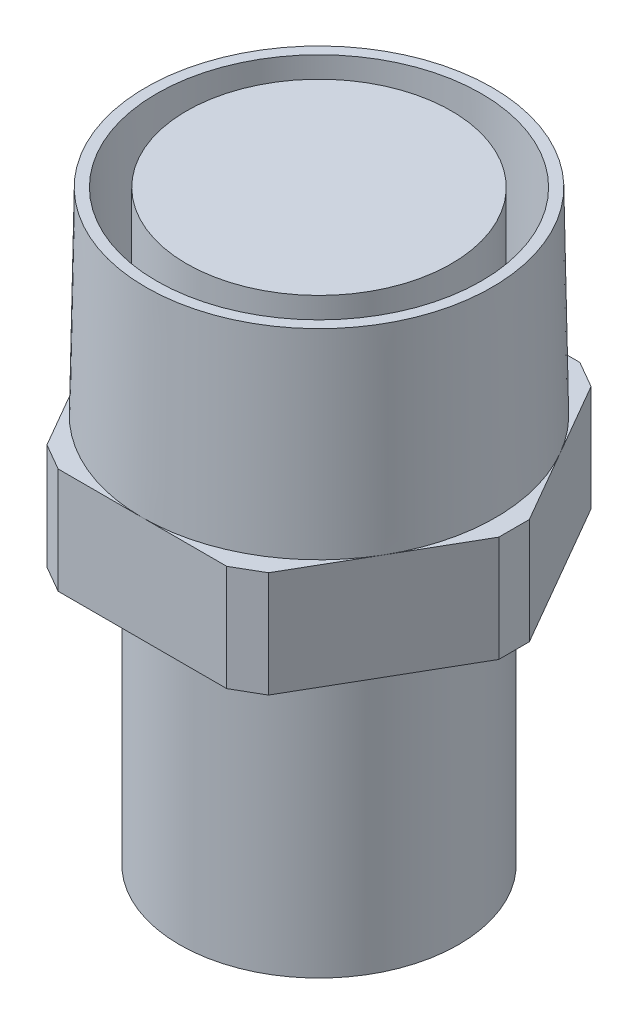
from build123d import *

# Parameters (mm, degrees)
EXTRUSION1_DEPTH = 3
ESQUISSE2_R      = 5
ESQUISSE2_R_2    = 4.5
EXTRUSION2_DEPTH = 5.6
EXTRUSION2_DRAFT = 1
ESQUISSE3_R      = 3.95
EXTRUSION3_DEPTH = 8
CHANFREIN1_SIZE  = 0.5
ESQUISSE4_R      = 3.75
EXTRUSION4_DEPTH = 5.6


with BuildPart() as part:
    # Esquisse1 → Extrusion1 (new body)
    with BuildSketch(Plane(origin=(0, 0, 0), x_dir=(1, 0, 0), z_dir=(0, 1, 0))):
        Polygon((5.773502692, 0), (2.886751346, 5), (-2.886751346, 5), (-5.773502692, 0), (-2.886751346, -5), (2.886751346, -5), align=None)
    extrude(amount=EXTRUSION1_DEPTH)


with BuildPart() as extrusion2_tool:
    # Esquisse2 → Extrusion2 (with draft: the straight prism first)
    with BuildSketch(Plane(origin=(0, 3, 0), x_dir=(1, 0, 0), z_dir=(0, 1, 0))):
        Circle(ESQUISSE2_R)
        Circle(ESQUISSE2_R_2, mode=Mode.SUBTRACT)
    extrude(amount=EXTRUSION2_DEPTH)
    # Extrusion2: the draft: its side faces are tilted about the plane it starts from
    extrusion2_sides = [extrusion2_tool.faces().sort_by_distance(p)[0] for p in [
        (-5, 5.8, 0),
        (-4.5, 5.8, 0),
    ]]
    draft(extrusion2_sides, Plane(origin=(0, 3, 0), x_dir=(1, 0, 0), z_dir=(0, 1, 0)), EXTRUSION2_DRAFT)


with BuildPart() as part_1:
    add(part.part)

    # Extrusion2: add extrusion2_tool
    add(extrusion2_tool.part)

    # Esquisse3 → Extrusion3 (add)
    with BuildSketch(Plane.XZ):
        with Locations(Location((0, 0, 0), (0, 0, 90))):
            Circle(ESQUISSE3_R)
    extrude(amount=EXTRUSION3_DEPTH)

    # Chanfrein1
    chanfrein1_edges = [part_1.edges().sort_by_distance(p)[0] for p in [
        (2.886751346, 1.5, 5),
        (-2.886751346, 1.5, 5),
        (-5.773502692, 1.5, 0),
        (-2.886751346, 1.5, -5),
        (2.886751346, 1.5, -5),
        (5.773502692, 1.5, 0),
    ]]
    chamfer(chanfrein1_edges, length=CHANFREIN1_SIZE)

    # Esquisse4 → Extrusion4 (add)
    with BuildSketch(Plane(origin=(0, 3, 0), x_dir=(1, 0, 0), z_dir=(0, 1, 0))):
        with Locations(Location((0, 0, 0), (0, 0, 270))):
            Circle(ESQUISSE4_R)
    extrude(amount=EXTRUSION4_DEPTH)


solid = part_1.part
